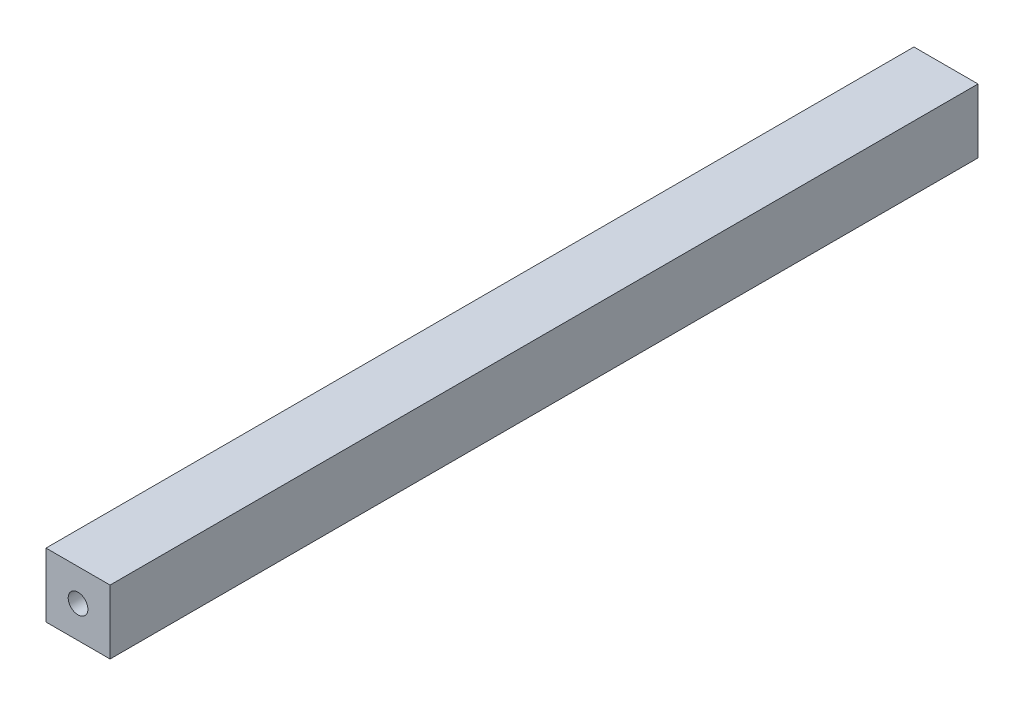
ISO-10303-21;
HEADER;
FILE_DESCRIPTION(('STEP AP214'),'2;1');
FILE_NAME('part.step','',(''),(''),'','','');
FILE_SCHEMA(('AUTOMOTIVE_DESIGN { 1 0 10303 214 1 1 1 1 }'));
ENDSEC;
DATA;
#1=APPLICATION_CONTEXT('core data for automotive mechanical design processes');
#2=APPLICATION_PROTOCOL_DEFINITION('international standard','automotive_design',2000,#1);
#3=PRODUCT_CONTEXT('',#1,'mechanical');
#4=PRODUCT('Part','Part','',(#3));
#5=PRODUCT_RELATED_PRODUCT_CATEGORY('part','',(#4));
#6=PRODUCT_DEFINITION_FORMATION('','',#4);
#7=PRODUCT_DEFINITION_CONTEXT('part definition',#1,'design');
#8=PRODUCT_DEFINITION('design','',#6,#7);
#9=PRODUCT_DEFINITION_SHAPE('','',#8);
#10=(LENGTH_UNIT() NAMED_UNIT(*) SI_UNIT(.MILLI.,.METRE.));
#11=(NAMED_UNIT(*) PLANE_ANGLE_UNIT() SI_UNIT($,.RADIAN.));
#12=(NAMED_UNIT(*) SI_UNIT($,.STERADIAN.) SOLID_ANGLE_UNIT());
#13=UNCERTAINTY_MEASURE_WITH_UNIT(LENGTH_MEASURE(1.E-05),#10,'distance_accuracy_value','');
#14=(GEOMETRIC_REPRESENTATION_CONTEXT(3) GLOBAL_UNCERTAINTY_ASSIGNED_CONTEXT((#13)) GLOBAL_UNIT_ASSIGNED_CONTEXT((#10,
#11,#12)) REPRESENTATION_CONTEXT('',''));
#15=CARTESIAN_POINT('',(0.,0.,0.));
#16=DIRECTION('',(0.,0.,1.));
#17=DIRECTION('',(1.,0.,0.));
#18=AXIS2_PLACEMENT_3D('',#15,#16,#17);
#19=CARTESIAN_POINT('',(0.,0.,298.));
#20=DIRECTION('',(1.,0.,0.));
#21=DIRECTION('',(0.,0.,-1.));
#22=AXIS2_PLACEMENT_3D('',#19,#20,#21);
#23=PLANE('',#22);
#24=DIRECTION('',(0.,-1.,0.));
#25=VECTOR('',#24,1.);
#26=CARTESIAN_POINT('',(0.,0.,0.));
#27=LINE('',#26,#25);
#28=CARTESIAN_POINT('',(0.,22.,0.));
#29=VERTEX_POINT('',#28);
#30=CARTESIAN_POINT('',(0.,0.,0.));
#31=VERTEX_POINT('',#30);
#32=EDGE_CURVE('E76',#29,#31,#27,.T.);
#33=ORIENTED_EDGE('',*,*,#32,.T.);
#34=DIRECTION('',(0.,0.,-1.));
#35=VECTOR('',#34,1.);
#36=CARTESIAN_POINT('',(0.,0.,298.));
#37=LINE('',#36,#35);
#38=CARTESIAN_POINT('',(0.,0.,298.));
#39=VERTEX_POINT('',#38);
#40=EDGE_CURVE('E11',#39,#31,#37,.T.);
#41=ORIENTED_EDGE('',*,*,#40,.F.);
#42=DIRECTION('',(0.,-1.,0.));
#43=VECTOR('',#42,1.);
#44=CARTESIAN_POINT('',(0.,0.,298.));
#45=LINE('',#44,#43);
#46=CARTESIAN_POINT('',(0.,22.,298.));
#47=VERTEX_POINT('',#46);
#48=EDGE_CURVE('E99',#47,#39,#45,.T.);
#49=ORIENTED_EDGE('',*,*,#48,.F.);
#50=DIRECTION('',(0.,0.,-1.));
#51=VECTOR('',#50,1.);
#52=CARTESIAN_POINT('',(0.,22.,298.));
#53=LINE('',#52,#51);
#54=EDGE_CURVE('E88',#47,#29,#53,.T.);
#55=ORIENTED_EDGE('',*,*,#54,.T.);
#56=EDGE_LOOP('',(#33,#41,#49,#55));
#57=FACE_BOUND('',#56,.T.);
#58=ADVANCED_FACE('F32',(#57),#23,.F.);
#59=CARTESIAN_POINT('',(0.,0.,298.));
#60=DIRECTION('',(0.,1.,0.));
#61=DIRECTION('',(0.,0.,1.));
#62=AXIS2_PLACEMENT_3D('',#59,#60,#61);
#63=PLANE('',#62);
#64=DIRECTION('',(1.,0.,0.));
#65=VECTOR('',#64,1.);
#66=CARTESIAN_POINT('',(0.,0.,0.));
#67=LINE('',#66,#65);
#68=CARTESIAN_POINT('',(22.,0.,0.));
#69=VERTEX_POINT('',#68);
#70=EDGE_CURVE('E72',#31,#69,#67,.T.);
#71=ORIENTED_EDGE('',*,*,#70,.T.);
#72=DIRECTION('',(0.,0.,-1.));
#73=VECTOR('',#72,1.);
#74=CARTESIAN_POINT('',(22.,0.,298.));
#75=LINE('',#74,#73);
#76=CARTESIAN_POINT('',(22.,0.,298.));
#77=VERTEX_POINT('',#76);
#78=EDGE_CURVE('E39',#77,#69,#75,.T.);
#79=ORIENTED_EDGE('',*,*,#78,.F.);
#80=DIRECTION('',(1.,0.,0.));
#81=VECTOR('',#80,1.);
#82=CARTESIAN_POINT('',(0.,0.,298.));
#83=LINE('',#82,#81);
#84=EDGE_CURVE('E84',#39,#77,#83,.T.);
#85=ORIENTED_EDGE('',*,*,#84,.F.);
#86=ORIENTED_EDGE('',*,*,#40,.T.);
#87=EDGE_LOOP('',(#71,#79,#85,#86));
#88=FACE_BOUND('',#87,.T.);
#89=ADVANCED_FACE('F83',(#88),#63,.F.);
#90=CARTESIAN_POINT('',(22.,0.,298.));
#91=DIRECTION('',(-1.,0.,0.));
#92=DIRECTION('',(0.,0.,1.));
#93=AXIS2_PLACEMENT_3D('',#90,#91,#92);
#94=PLANE('',#93);
#95=DIRECTION('',(0.,1.,0.));
#96=VECTOR('',#95,1.);
#97=CARTESIAN_POINT('',(22.,0.,0.));
#98=LINE('',#97,#96);
#99=CARTESIAN_POINT('',(22.,22.,0.));
#100=VERTEX_POINT('',#99);
#101=EDGE_CURVE('E77',#69,#100,#98,.T.);
#102=ORIENTED_EDGE('',*,*,#101,.T.);
#103=DIRECTION('',(0.,0.,-1.));
#104=VECTOR('',#103,1.);
#105=CARTESIAN_POINT('',(22.,22.,298.));
#106=LINE('',#105,#104);
#107=CARTESIAN_POINT('',(22.,22.,298.));
#108=VERTEX_POINT('',#107);
#109=EDGE_CURVE('E105',#108,#100,#106,.T.);
#110=ORIENTED_EDGE('',*,*,#109,.F.);
#111=DIRECTION('',(0.,1.,0.));
#112=VECTOR('',#111,1.);
#113=CARTESIAN_POINT('',(22.,0.,298.));
#114=LINE('',#113,#112);
#115=EDGE_CURVE('E51',#77,#108,#114,.T.);
#116=ORIENTED_EDGE('',*,*,#115,.F.);
#117=ORIENTED_EDGE('',*,*,#78,.T.);
#118=EDGE_LOOP('',(#102,#110,#116,#117));
#119=FACE_BOUND('',#118,.T.);
#120=ADVANCED_FACE('F108',(#119),#94,.F.);
#121=CARTESIAN_POINT('',(0.,22.,298.));
#122=DIRECTION('',(0.,-1.,0.));
#123=DIRECTION('',(0.,0.,-1.));
#124=AXIS2_PLACEMENT_3D('',#121,#122,#123);
#125=PLANE('',#124);
#126=DIRECTION('',(-1.,0.,0.));
#127=VECTOR('',#126,1.);
#128=CARTESIAN_POINT('',(0.,22.,0.));
#129=LINE('',#128,#127);
#130=EDGE_CURVE('E97',#100,#29,#129,.T.);
#131=ORIENTED_EDGE('',*,*,#130,.T.);
#132=ORIENTED_EDGE('',*,*,#54,.F.);
#133=DIRECTION('',(-1.,0.,0.));
#134=VECTOR('',#133,1.);
#135=CARTESIAN_POINT('',(0.,22.,298.));
#136=LINE('',#135,#134);
#137=EDGE_CURVE('E46',#108,#47,#136,.T.);
#138=ORIENTED_EDGE('',*,*,#137,.F.);
#139=ORIENTED_EDGE('',*,*,#109,.T.);
#140=EDGE_LOOP('',(#131,#132,#138,#139));
#141=FACE_BOUND('',#140,.T.);
#142=ADVANCED_FACE('F110',(#141),#125,.F.);
#143=CARTESIAN_POINT('',(0.,22.,298.));
#144=DIRECTION('',(0.,0.,-1.));
#145=DIRECTION('',(-1.,0.,0.));
#146=AXIS2_PLACEMENT_3D('',#143,#144,#145);
#147=PLANE('',#146);
#148=CARTESIAN_POINT('',(11.,11.,298.));
#149=DIRECTION('',(0.,0.,1.));
#150=DIRECTION('',(1.,0.,0.));
#151=AXIS2_PLACEMENT_3D('',#148,#149,#150);
#152=CIRCLE('',#151,3.375);
#153=CARTESIAN_POINT('',(14.375,11.,298.));
#154=VERTEX_POINT('',#153);
#155=EDGE_CURVE('E92',#154,#154,#152,.T.);
#156=ORIENTED_EDGE('',*,*,#155,.F.);
#157=EDGE_LOOP('',(#156));
#158=FACE_BOUND('',#157,.T.);
#159=ORIENTED_EDGE('',*,*,#48,.T.);
#160=ORIENTED_EDGE('',*,*,#84,.T.);
#161=ORIENTED_EDGE('',*,*,#115,.T.);
#162=ORIENTED_EDGE('',*,*,#137,.T.);
#163=EDGE_LOOP('',(#159,#160,#161,#162));
#164=FACE_BOUND('',#163,.T.);
#165=ADVANCED_FACE('F111',(#158,#164),#147,.F.);
#166=CARTESIAN_POINT('',(0.,22.,0.));
#167=DIRECTION('',(0.,0.,-1.));
#168=DIRECTION('',(-1.,0.,0.));
#169=AXIS2_PLACEMENT_3D('',#166,#167,#168);
#170=PLANE('',#169);
#171=CARTESIAN_POINT('',(11.,11.,0.));
#172=DIRECTION('',(0.,0.,-1.));
#173=DIRECTION('',(-1.,0.,0.));
#174=AXIS2_PLACEMENT_3D('',#171,#172,#173);
#175=CIRCLE('',#174,3.375);
#176=CARTESIAN_POINT('',(7.625,11.,0.));
#177=VERTEX_POINT('',#176);
#178=EDGE_CURVE('E194',#177,#177,#175,.T.);
#179=ORIENTED_EDGE('',*,*,#178,.F.);
#180=EDGE_LOOP('',(#179));
#181=FACE_BOUND('',#180,.T.);
#182=ORIENTED_EDGE('',*,*,#32,.F.);
#183=ORIENTED_EDGE('',*,*,#130,.F.);
#184=ORIENTED_EDGE('',*,*,#101,.F.);
#185=ORIENTED_EDGE('',*,*,#70,.F.);
#186=EDGE_LOOP('',(#182,#183,#184,#185));
#187=FACE_BOUND('',#186,.T.);
#188=ADVANCED_FACE('F73',(#181,#187),#170,.T.);
#189=CARTESIAN_POINT('',(11.,11.,273.));
#190=DIRECTION('',(0.,0.,1.));
#191=DIRECTION('',(1.,0.,0.));
#192=AXIS2_PLACEMENT_3D('',#189,#190,#191);
#193=CYLINDRICAL_SURFACE('',#192,3.375);
#194=CARTESIAN_POINT('',(11.,11.,273.));
#195=DIRECTION('',(0.,0.,1.));
#196=DIRECTION('',(1.,0.,0.));
#197=AXIS2_PLACEMENT_3D('',#194,#195,#196);
#198=CIRCLE('',#197,3.375);
#199=CARTESIAN_POINT('',(14.375,11.,273.));
#200=VERTEX_POINT('',#199);
#201=EDGE_CURVE('E89',#200,#200,#198,.T.);
#202=ORIENTED_EDGE('',*,*,#201,.F.);
#203=EDGE_LOOP('',(#202));
#204=FACE_BOUND('',#203,.T.);
#205=ORIENTED_EDGE('',*,*,#155,.T.);
#206=EDGE_LOOP('',(#205));
#207=FACE_BOUND('',#206,.T.);
#208=ADVANCED_FACE('F119',(#204,#207),#193,.F.);
#209=CARTESIAN_POINT('',(11.,11.,273.));
#210=DIRECTION('',(0.,0.,1.));
#211=DIRECTION('',(1.,0.,0.));
#212=AXIS2_PLACEMENT_3D('',#209,#210,#211);
#213=PLANE('',#212);
#214=ORIENTED_EDGE('',*,*,#201,.T.);
#215=EDGE_LOOP('',(#214));
#216=FACE_BOUND('',#215,.T.);
#217=ADVANCED_FACE('F157',(#216),#213,.T.);
#218=CARTESIAN_POINT('',(11.,11.,25.));
#219=DIRECTION('',(0.,0.,-1.));
#220=DIRECTION('',(-1.,0.,0.));
#221=AXIS2_PLACEMENT_3D('',#218,#219,#220);
#222=CYLINDRICAL_SURFACE('',#221,3.375);
#223=CARTESIAN_POINT('',(11.,11.,25.));
#224=DIRECTION('',(0.,0.,-1.));
#225=DIRECTION('',(-1.,0.,0.));
#226=AXIS2_PLACEMENT_3D('',#223,#224,#225);
#227=CIRCLE('',#226,3.375);
#228=CARTESIAN_POINT('',(7.625,11.,25.));
#229=VERTEX_POINT('',#228);
#230=EDGE_CURVE('E193',#229,#229,#227,.T.);
#231=ORIENTED_EDGE('',*,*,#230,.F.);
#232=EDGE_LOOP('',(#231));
#233=FACE_BOUND('',#232,.T.);
#234=ORIENTED_EDGE('',*,*,#178,.T.);
#235=EDGE_LOOP('',(#234));
#236=FACE_BOUND('',#235,.T.);
#237=ADVANCED_FACE('F167',(#233,#236),#222,.F.);
#238=CARTESIAN_POINT('',(11.,11.,25.));
#239=DIRECTION('',(0.,0.,-1.));
#240=DIRECTION('',(-1.,0.,0.));
#241=AXIS2_PLACEMENT_3D('',#238,#239,#240);
#242=PLANE('',#241);
#243=ORIENTED_EDGE('',*,*,#230,.T.);
#244=EDGE_LOOP('',(#243));
#245=FACE_BOUND('',#244,.T.);
#246=ADVANCED_FACE('F177',(#245),#242,.T.);
#247=CLOSED_SHELL('',(#58,#89,#120,#142,#165,#188,#208,#217,#237,#246));
#248=MANIFOLD_SOLID_BREP('B2',#247);
#249=ADVANCED_BREP_SHAPE_REPRESENTATION('',(#18,#248),#14);
#250=SHAPE_DEFINITION_REPRESENTATION(#9,#249);
ENDSEC;
END-ISO-10303-21;
